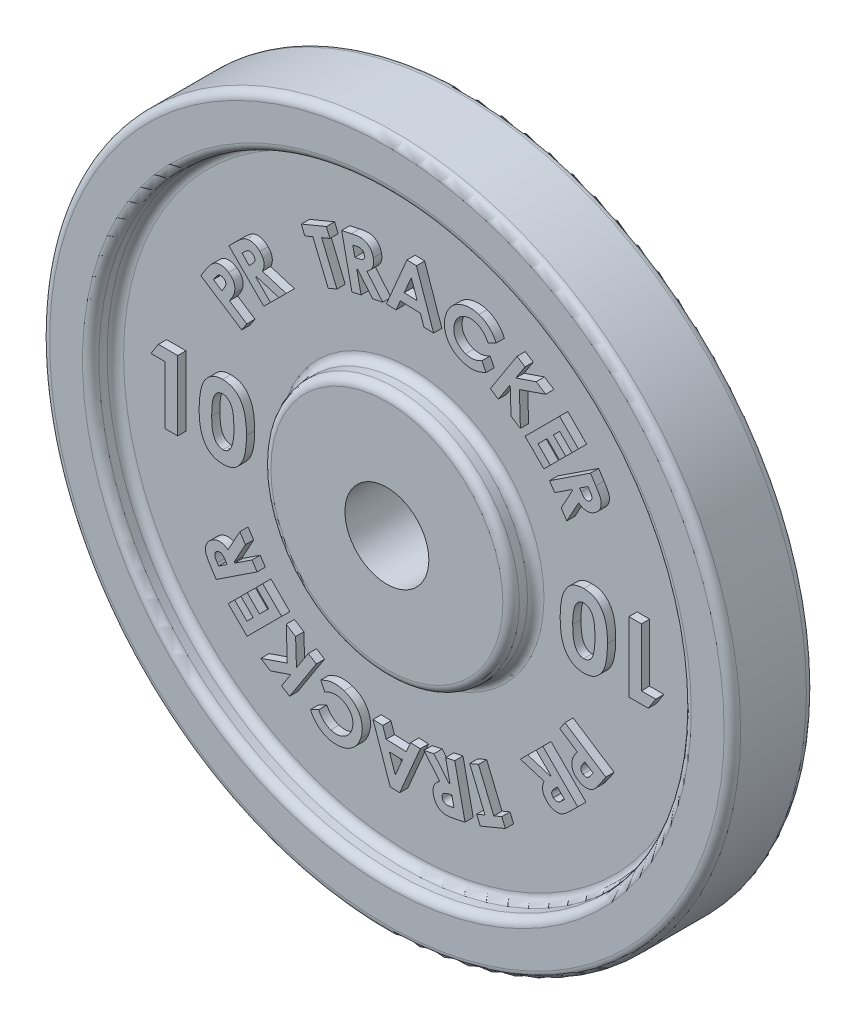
from build123d import *

# Parameters (mm, degrees)
ESBO_O1_R                = 21
ESBO_O1_R_2              = 2.55
RESSALTO_EXTRUS_O1_DEPTH = 5
ESBO_O2_R                = 18
ESBO_O2_R_2              = 7.55
CORTE_EXTRUS_O1_DEPTH    = 1.5
FILETE1_R                = 0.5
RESSALTO_EXTRUS_O2_DEPTH = 0.5
RESSALTO_EXTRUS_O3_DEPTH = 0.5
PADR_OCIRCULAR1_COUNT    = 2
FILETE2_R                = 0.5
FILETE3_R                = 0.5
RESSALTO_EXTRUS_O4_DEPTH = 0.5
RESSALTO_EXTRUS_O5_DEPTH = 0.5
PADR_OCIRCULAR2_COUNT    = 2


with BuildPart() as part:
    # Esbo_o1 → Ressalto-extrus_o1 (new body)
    with BuildSketch(Plane.XY):
        Circle(ESBO_O1_R)
        Circle(ESBO_O1_R_2, mode=Mode.SUBTRACT)
    extrude(amount=RESSALTO_EXTRUS_O1_DEPTH)

    # Esbo_o2 → Corte-extrus_o1 (cut)
    with BuildSketch(Plane.XY.offset(5)):
        Circle(ESBO_O2_R)
        Circle(ESBO_O2_R_2, mode=Mode.SUBTRACT)
    corte_extrus_o1 = extrude(amount=-CORTE_EXTRUS_O1_DEPTH, mode=Mode.SUBTRACT)

    # Filete1
    filete1_edges = [part.edges().sort_by_distance(p)[0] for p in [
        (-7.55, 0, 5),
        (-18, 0, 3.5),
        (-7.55, 0, 3.5),
        (-18, 0, 5),
    ]]
    fillet(filete1_edges, radius=FILETE1_R)

    # Esbo_o3 → Ressalto-extrus_o2 (add)
    # profile 1 of 9: a face of its own
    with BuildSketch(Plane.XY.offset(3.5)):
        with BuildLine():
            Line((11.372106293, 8.482696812), (11.70263514, 7.980893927))
            add(Edge.make_bspline(
                [(11.70263514, 7.980893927), (11.724196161, 7.947521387), (11.76576219, 7.883184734), (11.823642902, 7.789141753), (11.873676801, 7.700688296), (11.916269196, 7.618168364), (11.9531268, 7.542072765), (11.980870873, 7.471076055), (12.003586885, 7.406664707), (12.021625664, 7.328534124), (12.03179376, 7.234371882), (12.026669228, 7.122080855), (12.001764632, 7.010507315), (11.967025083, 6.919591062), (11.931859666, 6.848115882), (11.899674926, 6.79663945), (11.864071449, 6.746943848), (11.824230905, 6.699405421), (11.780243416, 6.653640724), (11.732185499, 6.609991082), (11.680364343, 6.567911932), (11.642951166, 6.542901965), (11.623909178, 6.530172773)],
                knots=[0, 0, 0, 0, 1.424579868, 2.746350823, 3.958867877, 5.067175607, 6.076040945, 6.988342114, 7.799210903, 8.522229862, 9.85875015, 11.181925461, 12.534388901, 13.939130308, 14.6618638, 15.387446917, 16.113030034, 16.852417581, 17.609320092, 18.387197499, 19.179140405, 20, 20, 20, 20], degree=3))
            add(Edge.make_bspline(
                [(11.623909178, 6.530172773), (11.603651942, 6.517253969), (11.563893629, 6.491898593), (11.502471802, 6.459700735), (11.441435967, 6.4320533), (11.380132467, 6.410855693), (11.319315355, 6.393320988), (11.258225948, 6.382908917), (11.197384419, 6.37656645), (11.136436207, 6.37605724), (11.075684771, 6.380787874), (11.01502661, 6.391326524), (10.954290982, 6.40654737), (10.894169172, 6.429160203), (10.833127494, 6.454272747), (10.77304555, 6.486804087), (10.712688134, 6.523926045), (10.673802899, 6.552333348), (10.653957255, 6.566831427)],
                knots=[0, 0, 0, 0, 1.102086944, 2.163035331, 3.179481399, 4.173821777, 5.137300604, 6.080390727, 7.013391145, 7.941897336, 8.873265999, 9.805722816, 10.76445368, 11.741476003, 12.750579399, 13.790977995, 14.872593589, 16, 16, 16, 16], degree=3))
            Line((10.653957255, 6.566831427), (9.936409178, 5.250124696))
            Line((9.936409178, 5.250124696), (9.595663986, 5.766951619))
            Line((9.595663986, 5.766951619), (10.279558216, 7.020557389))
            Line((10.279558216, 7.020557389), (10.250712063, 7.065028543))
            Line((10.250712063, 7.065028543), (9.197827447, 6.370917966))
            Line((9.197827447, 6.370917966), (8.885928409, 6.843874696))
            Line((8.885928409, 6.843874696), (11.372106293, 8.482696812))
        make_face()
        with BuildLine():
            Line((10.712250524, 7.369115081), (10.810207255, 7.220076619))
            add(Edge.make_bspline(
                [(10.810207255, 7.220076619), (10.82222925, 7.201908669), (10.845308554, 7.167030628), (10.881668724, 7.119046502), (10.916195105, 7.076232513), (10.949997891, 7.039374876), (10.982453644, 7.008009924), (11.013544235, 6.981619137), (11.044400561, 6.961738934), (11.083194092, 6.942255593), (11.134321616, 6.929880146), (11.19829258, 6.932687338), (11.264419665, 6.953846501), (11.305669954, 6.978554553), (11.32763514, 6.991711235)],
                knots=[0, 0, 0, 0, 1.203101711, 2.309662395, 3.324143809, 4.240453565, 5.070005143, 5.816667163, 6.488851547, 7.092611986, 8.2090873, 9.349703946, 10.588755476, 12, 12, 12, 12], degree=3))
            add(Edge.make_bspline(
                [(11.32763514, 6.991711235), (11.340342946, 7.000767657), (11.365409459, 7.01863171), (11.397276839, 7.051005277), (11.422317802, 7.087453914), (11.441728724, 7.126408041), (11.454266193, 7.167891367), (11.460187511, 7.210446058), (11.460451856, 7.253814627), (11.452661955, 7.300191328), (11.434169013, 7.353004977), (11.403911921, 7.416123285), (11.360818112, 7.491805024), (11.326138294, 7.545387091), (11.307202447, 7.574643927)],
                knots=[0, 0, 0, 0, 0.842179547, 1.661223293, 2.4389524, 3.223208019, 4.003944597, 4.769372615, 5.537932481, 6.338747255, 7.29721474, 8.551489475, 10.117047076, 12, 12, 12, 12], degree=3))
            Line((11.307202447, 7.574643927), (11.221264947, 7.705052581))
            Line((11.221264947, 7.705052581), (10.712250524, 7.369115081))
        make_face(mode=Mode.SUBTRACT)
    # profile 2 of 9: a face of its own
    with BuildSketch(Plane.XY.offset(3.5)):
        Polygon((9.497131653, 10.539133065), (10.643766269, 9.392498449), (10.252540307, 9.001272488), (9.503141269, 9.750671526), (9.123333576, 9.370863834), (9.872732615, 8.621464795), (9.488718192, 8.237450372), (8.739319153, 8.986849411), (8.187035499, 8.434565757), (8.936434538, 7.685166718), (8.544006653, 7.292738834), (7.397372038, 8.439373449), align=None)
    # profile 3 of 9: a face of its own
    with BuildSketch(Plane.XY.offset(3.5)):
        Polygon((6.914354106, 12.404591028), (7.398128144, 12.092091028), (6.838632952, 11.227307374), (8.080219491, 11.650384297), (8.655940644, 11.277788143), (7.053176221, 10.72550449), (7.11507526, 8.709278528), (6.547767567, 9.075865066), (6.494281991, 10.69425449), (5.771926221, 9.578268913), (5.288152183, 9.890768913), align=None)
    # profile 4 of 9: a face of its own
    with BuildSketch(Plane.XY.offset(3.5)):
        with BuildLine():
            Line((5.643245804, 12.465489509), (5.14564965, 12.22750874))
            add(Edge.make_bspline(
                [(5.14564965, 12.22750874), (5.124240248, 12.270637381), (5.08238287, 12.354957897), (5.00706436, 12.470935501), (4.925885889, 12.576147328), (4.8364413, 12.668755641), (4.740854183, 12.750845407), (4.636864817, 12.819650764), (4.526124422, 12.877448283), (4.447693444, 12.906043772), (4.408269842, 12.920417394)],
                knots=[0, 0, 0, 0, 1.108720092, 2.167651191, 3.18060078, 4.166538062, 5.129360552, 6.078037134, 7.033918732, 8, 8, 8, 8], degree=3))
            add(Edge.make_bspline(
                [(4.408269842, 12.920417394), (4.374572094, 12.930426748), (4.308244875, 12.950128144), (4.20743273, 12.969055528), (4.107941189, 12.976362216), (4.009462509, 12.975892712), (3.912242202, 12.963380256), (3.815944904, 12.941789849), (3.72111022, 12.909667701), (3.628914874, 12.867530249), (3.540271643, 12.818525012), (3.458639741, 12.760702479), (3.383840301, 12.69679356), (3.317503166, 12.624839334), (3.257358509, 12.547286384), (3.205773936, 12.461756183), (3.160882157, 12.369669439), (3.137626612, 12.304480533), (3.125817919, 12.271378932)],
                knots=[0, 0, 0, 0, 1.052060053, 2.070767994, 3.063437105, 4.035120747, 5.014106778, 5.991861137, 6.985689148, 8.005720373, 9.023421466, 10.013478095, 10.995783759, 11.96331235, 12.938580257, 13.929127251, 14.948452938, 16, 16, 16, 16], degree=3))
            add(Edge.make_bspline(
                [(3.125817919, 12.271378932), (3.118498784, 12.247826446), (3.104097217, 12.201483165), (3.088054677, 12.131334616), (3.075938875, 12.062137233), (3.067945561, 11.993527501), (3.06487748, 11.925441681), (3.066897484, 11.858001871), (3.072609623, 11.791291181), (3.083667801, 11.725686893), (3.098584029, 11.661415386), (3.117746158, 11.598917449), (3.141327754, 11.538489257), (3.169232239, 11.47995944), (3.200812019, 11.422929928), (3.237072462, 11.368310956), (3.277089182, 11.31540859), (3.321216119, 11.264964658), (3.368772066, 11.216562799), (3.419521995, 11.171968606), (3.473001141, 11.130439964), (3.529513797, 11.092992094), (3.588517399, 11.057556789), (3.650877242, 11.026911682), (3.715625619, 10.998527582), (3.760506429, 10.983385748), (3.783269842, 10.975705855)],
                knots=[0, 0, 0, 0, 1.08983963, 2.1444336, 3.178001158, 4.193971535, 5.19552419, 6.187598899, 7.174443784, 8.152670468, 9.125633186, 10.089121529, 11.039541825, 11.990127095, 12.953371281, 13.918526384, 14.88546701, 15.883372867, 16.878918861, 17.882661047, 18.867398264, 19.869381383, 20.877721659, 21.907298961, 22.938588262, 24, 24, 24, 24], degree=3))
            add(Edge.make_bspline(
                [(3.783269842, 10.975705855), (3.82212513, 10.96407343), (3.898580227, 10.941184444), (4.015139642, 10.921347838), (4.130158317, 10.915055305), (4.225424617, 10.918680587), (4.301950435, 10.930417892), (4.362185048, 10.942341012), (4.425160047, 10.95866318), (4.490718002, 10.979184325), (4.558828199, 11.004016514), (4.62946354, 11.032959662), (4.703130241, 11.065380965), (4.752502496, 11.089513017), (4.777861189, 11.101907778)],
                knots=[0, 0, 0, 0, 1.412340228, 2.779045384, 4.10748043, 5.421237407, 6.091506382, 6.803337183, 7.560088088, 8.35707087, 9.196132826, 10.085318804, 11.016576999, 12, 12, 12, 12], degree=3))
            Line((4.777861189, 11.101907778), (5.020048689, 10.599503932))
            add(Edge.make_bspline(
                [(5.020048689, 10.599503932), (4.986137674, 10.582965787), (4.91971388, 10.550571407), (4.819970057, 10.508372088), (4.723678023, 10.470788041), (4.630302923, 10.438698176), (4.539814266, 10.412426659), (4.452316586, 10.390824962), (4.367745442, 10.376061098), (4.285510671, 10.365955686), (4.204189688, 10.362076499), (4.122362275, 10.362044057), (4.039098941, 10.366209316), (3.95461992, 10.375168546), (3.868879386, 10.389396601), (3.781937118, 10.407109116), (3.69381468, 10.430250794), (3.635166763, 10.448440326), (3.605385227, 10.457677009)],
                knots=[0, 0, 0, 0, 1.235616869, 2.420286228, 3.546204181, 4.621062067, 5.653067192, 6.631820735, 7.5714333, 8.463446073, 9.343896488, 10.236271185, 11.14293321, 12.073336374, 13.017223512, 13.98880256, 14.978709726, 16, 16, 16, 16], degree=3))
            add(Edge.make_bspline(
                [(3.605385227, 10.457677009), (3.551727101, 10.476565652), (3.446398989, 10.513643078), (3.297649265, 10.584292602), (3.161014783, 10.665870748), (3.035742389, 10.757492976), (2.922155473, 10.860013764), (2.820622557, 10.973645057), (2.731387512, 11.098072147), (2.654896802, 11.231948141), (2.591081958, 11.372150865), (2.543576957, 11.517568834), (2.51058845, 11.665663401), (2.494729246, 11.817233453), (2.49340558, 11.971430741), (2.508187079, 12.128829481), (2.538861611, 12.289174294), (2.570587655, 12.395221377), (2.586755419, 12.449263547)],
                knots=[0, 0, 0, 0, 1.087256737, 2.134228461, 3.142668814, 4.126448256, 5.097398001, 6.063225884, 7.034900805, 8.019872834, 9.007433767, 9.975333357, 10.94012752, 11.903376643, 12.884071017, 13.884292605, 14.921823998, 16, 16, 16, 16], degree=3))
            add(Edge.make_bspline(
                [(2.586755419, 12.449263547), (2.598710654, 12.484095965), (2.622351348, 12.552974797), (2.665512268, 12.65208616), (2.712703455, 12.746597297), (2.765297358, 12.83581344), (2.822358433, 12.920395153), (2.885131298, 12.999649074), (2.952295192, 13.074640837), (3.025439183, 13.143444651), (3.102079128, 13.208027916), (3.183365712, 13.26630797), (3.268736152, 13.318674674), (3.357150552, 13.366279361), (3.450083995, 13.4073008), (3.546606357, 13.442756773), (3.647299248, 13.471979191), (3.750740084, 13.496147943), (3.856160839, 13.5133832), (3.962121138, 13.524247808), (4.067899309, 13.528599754), (4.173333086, 13.525669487), (4.278030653, 13.51504725), (4.38247792, 13.499035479), (4.486764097, 13.475736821), (4.555235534, 13.454541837), (4.589760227, 13.443854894)],
                knots=[0, 0, 0, 0, 1.061962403, 2.099961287, 3.115586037, 4.107642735, 5.085323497, 6.056407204, 7.021973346, 7.986605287, 8.950665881, 9.911273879, 10.868678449, 11.838127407, 12.805645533, 13.796506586, 14.802219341, 15.828295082, 16.859046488, 17.881389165, 18.899230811, 19.910902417, 20.921170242, 21.932973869, 22.95776332, 24, 24, 24, 24], degree=3))
            add(Edge.make_bspline(
                [(4.589760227, 13.443854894), (4.618936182, 13.433780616), (4.676886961, 13.413770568), (4.761345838, 13.377748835), (4.843666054, 13.338236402), (4.923879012, 13.294368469), (5.001343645, 13.245522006), (5.076553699, 13.192561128), (5.149572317, 13.135420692), (5.219496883, 13.073515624), (5.286779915, 13.008408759), (5.349692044, 12.939580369), (5.409691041, 12.868696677), (5.464914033, 12.794246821), (5.515403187, 12.716290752), (5.562227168, 12.635625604), (5.605999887, 12.552367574), (5.630803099, 12.494512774), (5.643245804, 12.465489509)],
                knots=[0, 0, 0, 0, 0.998866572, 1.984000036, 2.970072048, 3.953860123, 4.941572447, 5.932833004, 6.93037271, 7.941144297, 8.954553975, 9.959547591, 10.958329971, 11.959530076, 12.957722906, 13.963113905, 14.978181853, 16, 16, 16, 16], degree=3))
        make_face()
    # profile 5 of 9: a face of its own
    with BuildSketch(Plane.XY.offset(3.5)):
        Polygon((0.221709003, 14.132780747), (0.798031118, 14.112949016), (1.841300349, 11.088910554), (1.251156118, 11.109343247), (1.039617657, 11.732540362), (-0.177329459, 11.775208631), (-0.442353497, 11.168838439), (-1.03309869, 11.189271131), align=None)
        Polygon((0.48613208, 13.331098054), (0.05283881, 12.320881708), (0.84550708, 12.293237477), align=None, mode=Mode.SUBTRACT)
    # profile 6 of 9: a face of its own
    with BuildSketch(Plane.XY.offset(3.5)):
        with BuildLine():
            Line((-3.748977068, 13.699248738), (-3.157630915, 13.825450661))
            add(Edge.make_bspline(
                [(-3.157630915, 13.825450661), (-3.11861599, 13.833511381), (-3.043380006, 13.849055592), (-2.934083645, 13.867484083), (-2.832907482, 13.882026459), (-2.739971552, 13.892808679), (-2.655085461, 13.897468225), (-2.578472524, 13.898277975), (-2.509931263, 13.895221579), (-2.448440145, 13.886614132), (-2.392018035, 13.873700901), (-2.338344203, 13.856855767), (-2.286494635, 13.835739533), (-2.236425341, 13.810444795), (-2.18841238, 13.780791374), (-2.141582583, 13.747562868), (-2.096919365, 13.709826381), (-2.054116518, 13.66827923), (-2.014059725, 13.623221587), (-1.976360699, 13.575329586), (-1.943582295, 13.523161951), (-1.91349983, 13.46837792), (-1.886135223, 13.410817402), (-1.863720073, 13.349652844), (-1.843355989, 13.285833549), (-1.833382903, 13.241604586), (-1.828303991, 13.219080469)],
                knots=[0, 0, 0, 0, 1.704973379, 3.287853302, 4.742851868, 6.079738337, 7.290568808, 8.379457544, 9.358207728, 10.223935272, 11.033000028, 11.832927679, 12.628986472, 13.426521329, 14.230847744, 15.042135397, 15.881916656, 16.730752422, 17.592991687, 18.460754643, 19.335982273, 20.226199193, 21.135209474, 22.060410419, 23.012241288, 24, 24, 24, 24], degree=3))
            add(Edge.make_bspline(
                [(-1.828303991, 13.219080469), (-1.823872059, 13.195484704), (-1.815156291, 13.14908165), (-1.806151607, 13.079895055), (-1.804393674, 13.012561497), (-1.805508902, 12.947236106), (-1.813270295, 12.884248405), (-1.824014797, 12.822858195), (-1.842141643, 12.764069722), (-1.863436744, 12.706792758), (-1.890100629, 12.651605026), (-1.922242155, 12.59876618), (-1.958776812, 12.547363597), (-2.001295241, 12.498744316), (-2.048305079, 12.451798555), (-2.100051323, 12.406492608), (-2.157370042, 12.363888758), (-2.198138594, 12.337636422), (-2.218928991, 12.324248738)],
                knots=[0, 0, 0, 0, 1.09581435, 2.155011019, 3.179669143, 4.167483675, 5.133737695, 6.073368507, 7.007780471, 7.936629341, 8.860786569, 9.800016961, 10.756576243, 11.735379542, 12.74392103, 13.787214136, 14.871564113, 16, 16, 16, 16], degree=3))
            Line((-2.218928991, 12.324248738), (-1.24957803, 11.169801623))
            Line((-1.24957803, 11.169801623), (-1.858352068, 11.040594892))
            Line((-1.858352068, 11.040594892), (-2.78082803, 12.140955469))
            Line((-2.78082803, 12.140955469), (-2.832510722, 12.130138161))
            Line((-2.832510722, 12.130138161), (-2.569289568, 10.889753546))
            Line((-2.569289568, 10.889753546), (-3.126981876, 10.770763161))
            Line((-3.126981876, 10.770763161), (-3.748977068, 13.699248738))
        make_face()
        with BuildLine():
            Line((-2.947895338, 12.673407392), (-2.77301553, 12.710066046))
            add(Edge.make_bspline(
                [(-2.77301553, 12.710066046), (-2.751752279, 12.714951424), (-2.710882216, 12.724341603), (-2.652449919, 12.739833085), (-2.599637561, 12.7564915), (-2.55256387, 12.774327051), (-2.511544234, 12.793726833), (-2.475741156, 12.813396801), (-2.445380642, 12.834177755), (-2.420718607, 12.857047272), (-2.400569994, 12.881222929), (-2.384681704, 12.907606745), (-2.372570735, 12.936138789), (-2.364310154, 12.966885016), (-2.3592735, 12.999749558), (-2.35908776, 13.034847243), (-2.361960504, 13.072080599), (-2.366720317, 13.097320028), (-2.369169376, 13.11030643)],
                knots=[0, 0, 0, 0, 1.598184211, 3.071867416, 4.427024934, 5.653385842, 6.756228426, 7.748257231, 8.643888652, 9.443485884, 10.204445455, 10.941834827, 11.691389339, 12.467479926, 13.268557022, 14.119810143, 15.03258895, 16, 16, 16, 16], degree=3))
            add(Edge.make_bspline(
                [(-2.369169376, 13.11030643), (-2.372857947, 13.125700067), (-2.380042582, 13.155683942), (-2.399338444, 13.197067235), (-2.423545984, 13.234165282), (-2.452965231, 13.266917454), (-2.487429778, 13.29339287), (-2.524430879, 13.316209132), (-2.56574844, 13.330438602), (-2.602384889, 13.339094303), (-2.634940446, 13.342056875), (-2.663868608, 13.342735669), (-2.696718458, 13.340386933), (-2.733862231, 13.337731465), (-2.774906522, 13.332025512), (-2.82036844, 13.324713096), (-2.869883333, 13.315816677), (-2.904241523, 13.308704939), (-2.922053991, 13.305017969)],
                knots=[0, 0, 0, 0, 1.131166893, 2.203297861, 3.249782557, 4.295873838, 5.337726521, 6.353877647, 7.393258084, 8.45137998, 9.042365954, 9.731131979, 10.521344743, 11.399396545, 12.397667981, 13.487316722, 14.697338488, 16, 16, 16, 16], degree=3))
            Line((-2.922053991, 13.305017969), (-3.075299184, 13.272566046))
            Line((-3.075299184, 13.272566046), (-2.947895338, 12.673407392))
        make_face(mode=Mode.SUBTRACT)
    # profile 7 of 9: a face of its own
    with BuildSketch(Plane.XY.offset(3.5)):
        Polygon((-6.202171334, 12.807926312), (-4.675128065, 13.440738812), (-4.459983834, 12.922109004), (-4.963589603, 12.712974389), (-4.033902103, 10.468984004), (-4.566954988, 10.24843112), (-5.496642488, 12.492421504), (-5.987027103, 12.289296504), align=None)
    # profile 8 of 9: a face of its own
    with BuildSketch(Plane.XY.offset(3.5)):
        with BuildLine():
            Line((-10.599505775, 9.467272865), (-10.169818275, 9.895758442))
            add(Edge.make_bspline(
                [(-10.169818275, 9.895758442), (-10.141316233, 9.923753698), (-10.086316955, 9.977775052), (-10.004693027, 10.053245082), (-9.927847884, 10.121209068), (-9.854635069, 10.179596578), (-9.786650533, 10.230950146), (-9.722492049, 10.272906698), (-9.66276536, 10.307043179), (-9.58963716, 10.341521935), (-9.498181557, 10.370464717), (-9.385940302, 10.386720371), (-9.270852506, 10.385232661), (-9.174136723, 10.36969788), (-9.097020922, 10.348445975), (-9.039330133, 10.327835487), (-8.983116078, 10.302648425), (-8.927889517, 10.272904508), (-8.874022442, 10.238562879), (-8.820893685, 10.200242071), (-8.769754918, 10.156522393), (-8.73697313, 10.125088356), (-8.720299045, 10.109099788)],
                knots=[0, 0, 0, 0, 1.421133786, 2.742306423, 3.954344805, 5.069496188, 6.072872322, 6.984049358, 7.794588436, 8.518273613, 9.856972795, 11.189283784, 12.536208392, 13.936227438, 14.660613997, 15.379652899, 16.113338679, 16.849856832, 17.609021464, 18.384434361, 19.178260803, 20, 20, 20, 20], degree=3))
            add(Edge.make_bspline(
                [(-8.720299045, 10.109099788), (-8.703367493, 10.091744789), (-8.670215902, 10.057764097), (-8.626574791, 10.003113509), (-8.587171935, 9.948329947), (-8.552602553, 9.892608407), (-8.524439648, 9.835297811), (-8.501444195, 9.777178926), (-8.483314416, 9.718356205), (-8.470503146, 9.658431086), (-8.463587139, 9.597468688), (-8.460710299, 9.53555021), (-8.464938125, 9.472467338), (-8.473067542, 9.408335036), (-8.487039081, 9.343233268), (-8.506670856, 9.277286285), (-8.530984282, 9.210072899), (-8.551304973, 9.165854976), (-8.561645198, 9.143354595)],
                knots=[0, 0, 0, 0, 1.103197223, 2.160034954, 3.179906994, 4.174678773, 5.141294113, 6.082891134, 7.017573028, 7.940524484, 8.868105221, 9.808155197, 10.758194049, 11.742332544, 12.749361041, 13.785374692, 14.873083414, 16, 16, 16, 16], degree=3))
            Line((-8.561645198, 9.143354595), (-7.116332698, 8.698643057))
            Line((-7.116332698, 8.698643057), (-7.558640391, 8.258138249))
            Line((-7.558640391, 8.258138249), (-8.934842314, 8.681816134))
            Line((-8.934842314, 8.681816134), (-8.972101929, 8.644556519))
            Line((-8.972101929, 8.644556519), (-8.074866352, 7.743715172))
            Line((-8.074866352, 7.743715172), (-8.479914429, 7.339869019))
            Line((-8.479914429, 7.339869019), (-10.599505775, 9.467272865))
        make_face()
        with BuildLine():
            Line((-9.365731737, 9.039388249), (-9.238928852, 9.165590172))
            add(Edge.make_bspline(
                [(-9.238928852, 9.165590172), (-9.223627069, 9.181339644), (-9.1941939, 9.211633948), (-9.153196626, 9.256307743), (-9.118169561, 9.299445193), (-9.087893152, 9.33978526), (-9.063884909, 9.378651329), (-9.04410206, 9.414677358), (-9.030162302, 9.448956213), (-9.018589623, 9.491275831), (-9.016852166, 9.544258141), (-9.031818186, 9.607060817), (-9.066072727, 9.668099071), (-9.098869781, 9.703716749), (-9.116332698, 9.722681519)],
                knots=[0, 0, 0, 0, 1.202674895, 2.313360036, 3.319177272, 4.245179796, 5.073189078, 5.819223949, 6.493567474, 7.094979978, 8.214892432, 9.353828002, 10.591035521, 12, 12, 12, 12], degree=3))
            add(Edge.make_bspline(
                [(-9.116332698, 9.722681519), (-9.127824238, 9.733508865), (-9.150421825, 9.754800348), (-9.189346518, 9.779172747), (-9.230006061, 9.797904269), (-9.272853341, 9.80847089), (-9.316140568, 9.812471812), (-9.359674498, 9.811300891), (-9.402203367, 9.800892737), (-9.43762212, 9.788141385), (-9.46625409, 9.772592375), (-9.490907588, 9.757895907), (-9.517199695, 9.737993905), (-9.546842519, 9.715441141), (-9.578406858, 9.688202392), (-9.612880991, 9.65736726), (-9.649898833, 9.622852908), (-9.674898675, 9.597956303), (-9.687847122, 9.585061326)],
                knots=[0, 0, 0, 0, 1.125004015, 2.212269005, 3.262387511, 4.310165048, 5.344972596, 6.361525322, 7.402641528, 8.457426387, 9.039724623, 9.726656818, 10.504926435, 11.391944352, 12.386519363, 13.4806323, 14.695115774, 16, 16, 16, 16], degree=3))
            Line((-9.687847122, 9.585061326), (-9.799025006, 9.474484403))
            Line((-9.799025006, 9.474484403), (-9.365731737, 9.039388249))
        make_face(mode=Mode.SUBTRACT)
    # profile 9 of 9: a face of its own
    with BuildSketch(Plane.XY.offset(3.5)):
        with BuildLine():
            Line((-12.308870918, 7.044325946), (-11.98134688, 7.546128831))
            add(Edge.make_bspline(
                [(-11.98134688, 7.546128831), (-11.959636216, 7.578665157), (-11.917812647, 7.641343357), (-11.855330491, 7.730623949), (-11.794968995, 7.811310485), (-11.735855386, 7.882605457), (-11.68030535, 7.94608901), (-11.626652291, 8.000619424), (-11.575068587, 8.046433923), (-11.52510025, 8.084536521), (-11.475246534, 8.115763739), (-11.425066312, 8.142230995), (-11.373249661, 8.163866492), (-11.320451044, 8.182383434), (-11.265729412, 8.194956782), (-11.210059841, 8.20521918), (-11.152905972, 8.209628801), (-11.074873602, 8.210581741), (-10.975389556, 8.200198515), (-10.856174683, 8.170027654), (-10.737536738, 8.119701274), (-10.662507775, 8.074349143), (-10.623774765, 8.050936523)],
                knots=[0, 0, 0, 0, 1.407136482, 2.710717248, 3.919990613, 5.030955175, 6.041784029, 6.953954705, 7.781053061, 8.521898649, 9.211703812, 9.895079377, 10.560316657, 11.230338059, 11.905032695, 12.577993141, 13.26504473, 13.964123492, 15.383954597, 16.848671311, 18.373155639, 20, 20, 20, 20], degree=3))
            add(Edge.make_bspline(
                [(-10.623774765, 8.050936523), (-10.602739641, 8.036594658), (-10.561692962, 8.0086088), (-10.504605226, 7.962631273), (-10.45359978, 7.913595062), (-10.406916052, 7.863064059), (-10.367281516, 7.808759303), (-10.331957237, 7.752813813), (-10.302615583, 7.694018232), (-10.279094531, 7.632979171), (-10.261259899, 7.570345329), (-10.247856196, 7.50671609), (-10.240040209, 7.441975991), (-10.237618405, 7.376441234), (-10.240851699, 7.310158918), (-10.248630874, 7.243056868), (-10.261786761, 7.174910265), (-10.274673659, 7.129776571), (-10.281226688, 7.106825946)],
                knots=[0, 0, 0, 0, 1.124608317, 2.194493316, 3.233698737, 4.248804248, 5.229486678, 6.199567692, 7.169325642, 8.127585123, 9.085599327, 10.043777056, 10.997776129, 11.963162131, 12.9377548, 13.92690783, 14.945826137, 16, 16, 16, 16], degree=3))
            add(Edge.make_bspline(
                [(-10.281226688, 7.106825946), (-10.286271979, 7.092141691), (-10.297181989, 7.060388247), (-10.318515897, 7.010437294), (-10.346025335, 6.954630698), (-10.378136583, 6.891893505), (-10.417824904, 6.823723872), (-10.461958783, 6.748474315), (-10.512639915, 6.667567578), (-10.548589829, 6.611791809), (-10.56728438, 6.582787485)],
                knots=[0, 0, 0, 0, 0.622537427, 1.346183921, 2.176173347, 3.117576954, 4.171813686, 5.338785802, 6.616124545, 8, 8, 8, 8], degree=3))
            Line((-10.56728438, 6.582787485), (-9.514399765, 5.896489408))
            Line((-9.514399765, 5.896489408), (-9.822693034, 5.423532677))
            Line((-9.822693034, 5.423532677), (-12.308870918, 7.044325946))
        make_face()
        with BuildLine():
            Line((-11.028822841, 6.883869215), (-10.930265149, 7.034710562))
            add(Edge.make_bspline(
                [(-10.930265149, 7.034710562), (-10.912702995, 7.062157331), (-10.880443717, 7.112573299), (-10.840977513, 7.184219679), (-10.811208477, 7.243531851), (-10.794506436, 7.294263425), (-10.787318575, 7.338945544), (-10.787502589, 7.380666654), (-10.793223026, 7.421802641), (-10.806926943, 7.461344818), (-10.825809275, 7.499358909), (-10.8519373, 7.534169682), (-10.883729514, 7.566495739), (-10.90929918, 7.583999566), (-10.922452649, 7.593003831)],
                knots=[0, 0, 0, 0, 1.82986352, 3.361209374, 4.594483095, 5.551825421, 6.349238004, 7.125730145, 7.888067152, 8.670975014, 9.466161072, 10.26293814, 11.106426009, 12, 12, 12, 12], degree=3))
            add(Edge.make_bspline(
                [(-10.922452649, 7.593003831), (-10.934309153, 7.600318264), (-10.957170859, 7.614421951), (-10.993212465, 7.630081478), (-11.028808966, 7.641335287), (-11.064689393, 7.646638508), (-11.100257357, 7.647302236), (-11.135694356, 7.643086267), (-11.17099314, 7.633435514), (-11.193419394, 7.622991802), (-11.204904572, 7.617643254)],
                knots=[0, 0, 0, 0, 1.120226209, 2.160019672, 3.154816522, 4.117323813, 5.068961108, 6.011122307, 6.981434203, 8, 8, 8, 8], degree=3))
            add(Edge.make_bspline(
                [(-11.204904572, 7.617643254), (-11.213847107, 7.612843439), (-11.232650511, 7.602750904), (-11.260106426, 7.582112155), (-11.288481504, 7.556232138), (-11.318961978, 7.525451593), (-11.349627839, 7.488436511), (-11.383023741, 7.447308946), (-11.416466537, 7.399919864), (-11.438948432, 7.366486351), (-11.450697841, 7.349013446)],
                knots=[0, 0, 0, 0, 0.661727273, 1.391409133, 2.234074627, 3.167977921, 4.216097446, 5.369899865, 6.625466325, 8, 8, 8, 8], degree=3))
            Line((-11.450697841, 7.349013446), (-11.537837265, 7.215599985))
            Line((-11.537837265, 7.215599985), (-11.028822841, 6.883869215))
        make_face(mode=Mode.SUBTRACT)
    ressalto_extrus_o2 = extrude(amount=RESSALTO_EXTRUS_O2_DEPTH)

    # Esbo_o5 → Ressalto-extrus_o3 (add)
    # profile 1 of 2: a face of its own
    with BuildSketch(Plane.XY.offset(3.5)):
        Polygon((-14.886658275, 2.133333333), (-13.712145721, 2.133333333), (-13.712145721, -2.1), (-14.471974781, -2.1), (-14.471974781, 1.427777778), (-15.34035085, 1.427777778), align=None)
    # profile 2 of 2: a face of its own
    with BuildSketch(Plane.XY.offset(3.5)):
        with BuildLine():
            add(Edge.make_bspline(
                [(-10.984054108, 2.241880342), (-10.947275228, 2.241334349), (-10.874958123, 2.240260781), (-10.76844864, 2.228633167), (-10.66585056, 2.211067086), (-10.566762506, 2.186568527), (-10.471897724, 2.154145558), (-10.38056577, 2.115335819), (-10.293853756, 2.068103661), (-10.210655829, 2.014752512), (-10.131004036, 1.954351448), (-10.056812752, 1.885491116), (-9.986727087, 1.809755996), (-9.922264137, 1.726001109), (-9.86199635, 1.634988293), (-9.806121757, 1.536703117), (-9.755068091, 1.430664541), (-9.708263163, 1.31668121), (-9.666410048, 1.193044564), (-9.631157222, 1.058336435), (-9.600922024, 0.912526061), (-9.575401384, 0.755250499), (-9.556111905, 0.58630069), (-9.543110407, 0.405788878), (-9.534188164, 0.214063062), (-9.533459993, 0.082540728), (-9.533085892, 0.01497062)],
                knots=[0, 0, 0, 0, 0.879237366, 1.728815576, 2.559023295, 3.367336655, 4.166867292, 4.954216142, 5.737608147, 6.525189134, 7.316157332, 8.124696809, 8.942788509, 9.781158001, 10.649253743, 11.551476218, 12.482711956, 13.461909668, 14.496590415, 15.601789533, 16.789733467, 18.056700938, 19.410929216, 20.8549011, 22.384193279, 24, 24, 24, 24], degree=3))
            add(Edge.make_bspline(
                [(-9.533085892, 0.01497062), (-9.533490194, -0.053444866), (-9.534275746, -0.186374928), (-9.542739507, -0.379854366), (-9.557314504, -0.561676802), (-9.576099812, -0.731823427), (-9.601830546, -0.890204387), (-9.631964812, -1.037229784), (-9.667774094, -1.172846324), (-9.711005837, -1.296748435), (-9.757527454, -1.410931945), (-9.808720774, -1.516763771), (-9.863693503, -1.614530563), (-9.921184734, -1.705707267), (-9.984346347, -1.787606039), (-10.050104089, -1.863011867), (-10.121321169, -1.929052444), (-10.194999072, -1.989131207), (-10.273836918, -2.041051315), (-10.357021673, -2.086459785), (-10.446036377, -2.123291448), (-10.539258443, -2.155325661), (-10.638276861, -2.178322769), (-10.741518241, -2.196570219), (-10.850148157, -2.206654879), (-10.924107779, -2.207905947), (-10.962005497, -2.208547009)],
                knots=[0, 0, 0, 0, 1.643780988, 3.193836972, 4.651895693, 6.025988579, 7.305620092, 8.505800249, 9.631074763, 10.672816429, 11.65661981, 12.592235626, 13.49536222, 14.350718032, 15.179365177, 15.97804903, 16.751647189, 17.51006938, 18.259804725, 19.016521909, 19.783502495, 20.571750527, 21.382245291, 22.22305063, 23.089471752, 24, 24, 24, 24], degree=3))
            add(Edge.make_bspline(
                [(-10.962005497, -2.208547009), (-10.999902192, -2.207893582), (-11.074141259, -2.206613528), (-11.183064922, -2.196645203), (-11.286853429, -2.178248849), (-11.386655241, -2.155149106), (-11.481775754, -2.123362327), (-11.572671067, -2.085428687), (-11.658642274, -2.040303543), (-11.739927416, -1.988262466), (-11.816248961, -1.928585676), (-11.888792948, -1.861911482), (-11.957398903, -1.788408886), (-12.02102316, -1.707254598), (-12.080707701, -1.61953186), (-12.135830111, -1.524238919), (-12.186357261, -1.421514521), (-12.23386965, -1.311215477), (-12.275151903, -1.190967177), (-12.311891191, -1.059695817), (-12.341987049, -0.916307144), (-12.366192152, -0.760847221), (-12.385517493, -0.593645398), (-12.399893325, -0.414620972), (-12.408404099, -0.223690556), (-12.409181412, -0.09245457), (-12.409581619, -0.024886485)],
                knots=[0, 0, 0, 0, 0.917216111, 1.796812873, 2.643793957, 3.46689424, 4.273913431, 5.068098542, 5.848489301, 6.620921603, 7.401012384, 8.190319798, 9.003608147, 9.831726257, 10.68377682, 11.569763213, 12.493818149, 13.453288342, 14.474581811, 15.568529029, 16.750744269, 18.018426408, 19.375425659, 20.823733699, 22.36466933, 24, 24, 24, 24], degree=3))
            add(Edge.make_bspline(
                [(-12.409581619, -0.024886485), (-12.408856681, 0.06899405), (-12.407457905, 0.250137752), (-12.389731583, 0.511837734), (-12.363713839, 0.753734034), (-12.325499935, 0.97542202), (-12.278248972, 1.177722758), (-12.217741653, 1.359303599), (-12.148858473, 1.522677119), (-12.090161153, 1.619460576), (-12.061891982, 1.666072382)],
                knots=[0, 0, 0, 0, 1.288568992, 2.486310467, 3.599230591, 4.627010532, 5.572937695, 6.447898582, 7.252493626, 8, 8, 8, 8], degree=3))
            add(Edge.make_bspline(
                [(-12.061891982, 1.666072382), (-12.029021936, 1.711863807), (-11.96475452, 1.801395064), (-11.852381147, 1.918932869), (-11.731650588, 2.019456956), (-11.600083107, 2.100692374), (-11.459759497, 2.164754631), (-11.309475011, 2.210001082), (-11.149784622, 2.236363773), (-11.040122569, 2.240014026), (-10.984054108, 2.241880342)],
                knots=[0, 0, 0, 0, 1.058512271, 2.069600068, 3.047294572, 4.004278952, 4.967380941, 5.939006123, 6.946246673, 8, 8, 8, 8], degree=3))
        make_face()
        with BuildLine():
            add(Edge.make_bspline(
                [(-10.965397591, 1.482051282), (-10.998646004, 1.480475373), (-11.063830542, 1.477385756), (-11.158416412, 1.451159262), (-11.247604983, 1.410651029), (-11.315448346, 1.361905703), (-11.366228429, 1.315177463), (-11.401708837, 1.272889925), (-11.435924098, 1.225700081), (-11.46614474, 1.171478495), (-11.494680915, 1.112173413), (-11.522569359, 1.047515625), (-11.54543056, 0.975916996), (-11.567891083, 0.898596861), (-11.587568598, 0.813417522), (-11.604054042, 0.719682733), (-11.618782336, 0.616782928), (-11.629055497, 0.504650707), (-11.638633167, 0.383403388), (-11.645498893, 0.25277088), (-11.648369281, 0.112788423), (-11.64928169, 0.016384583), (-11.649752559, -0.03336672)],
                knots=[0, 0, 0, 0, 1.076674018, 2.110852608, 3.161083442, 4.239746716, 4.804137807, 5.395870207, 6.026861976, 6.692161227, 7.405688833, 8.16177676, 8.973626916, 9.841385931, 10.773283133, 11.807421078, 12.927755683, 14.143907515, 15.458935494, 16.872852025, 18.386167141, 20, 20, 20, 20], degree=3))
            add(Edge.make_bspline(
                [(-11.649752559, -0.03336672), (-11.648977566, -0.097821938), (-11.647491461, -0.221419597), (-11.639707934, -0.399157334), (-11.624106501, -0.560912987), (-11.604701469, -0.707782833), (-11.577446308, -0.838814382), (-11.546087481, -0.955247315), (-11.507362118, -1.055597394), (-11.462607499, -1.141315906), (-11.413039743, -1.214236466), (-11.359231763, -1.276219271), (-11.303015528, -1.329893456), (-11.242636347, -1.373492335), (-11.178238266, -1.406904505), (-11.110358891, -1.430937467), (-11.038955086, -1.445649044), (-10.990058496, -1.447689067), (-10.965397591, -1.448717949)],
                knots=[0, 0, 0, 0, 1.771748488, 3.397459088, 4.888034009, 6.237357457, 7.467047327, 8.564189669, 9.548206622, 10.417051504, 11.216568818, 11.965764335, 12.669334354, 13.348544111, 14.005342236, 14.656555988, 15.322436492, 16, 16, 16, 16], degree=3))
            add(Edge.make_bspline(
                [(-10.965397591, -1.448717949), (-10.94158297, -1.448013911), (-10.894956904, -1.446635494), (-10.826965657, -1.432486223), (-10.762668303, -1.409482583), (-10.702258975, -1.376942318), (-10.645521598, -1.335562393), (-10.592733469, -1.285160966), (-10.544292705, -1.225235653), (-10.516070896, -1.180762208), (-10.501528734, -1.157845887)],
                knots=[0, 0, 0, 0, 0.992283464, 1.942767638, 2.88273346, 3.832339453, 4.79467288, 5.803907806, 6.868395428, 8, 8, 8, 8], degree=3))
            add(Edge.make_bspline(
                [(-10.501528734, -1.157845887), (-10.484407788, -1.126531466), (-10.448506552, -1.060867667), (-10.40696158, -0.950062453), (-10.371991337, -0.825092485), (-10.341892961, -0.685568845), (-10.321307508, -0.530941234), (-10.303579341, -0.36219016), (-10.295028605, -0.17846586), (-10.293637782, -0.051181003), (-10.292914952, 0.01497062)],
                knots=[0, 0, 0, 0, 0.710965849, 1.490837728, 2.352621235, 3.297892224, 4.334225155, 5.461620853, 6.680770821, 8, 8, 8, 8], degree=3))
            add(Edge.make_bspline(
                [(-10.292914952, 0.01497062), (-10.293194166, 0.08169647), (-10.293731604, 0.210132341), (-10.303592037, 0.394517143), (-10.317323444, 0.562922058), (-10.337408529, 0.714971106), (-10.363251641, 0.851033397), (-10.395103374, 0.971100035), (-10.432654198, 1.075407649), (-10.477185, 1.16385223), (-10.52650563, 1.239017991), (-10.578860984, 1.303504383), (-10.634472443, 1.358561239), (-10.693247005, 1.404395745), (-10.756545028, 1.439416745), (-10.823157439, 1.464144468), (-10.893220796, 1.479103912), (-10.941013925, 1.481055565), (-10.965397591, 1.482051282)],
                knots=[0, 0, 0, 0, 1.793836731, 3.452829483, 4.963243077, 6.335886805, 7.574563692, 8.684454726, 9.672768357, 10.54971625, 11.340229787, 12.085688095, 12.778991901, 13.440269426, 14.083255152, 14.715733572, 15.344777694, 16, 16, 16, 16], degree=3))
        make_face(mode=Mode.SUBTRACT)
    ressalto_extrus_o3 = extrude(amount=RESSALTO_EXTRUS_O3_DEPTH)

    # Padr_oCircular1: Ressalto-extrus_o2, Ressalto-extrus_o3 ×2 about axis
    padr_ocircular1_axis = Axis((0, 0, 5), (0, 0, 1))
    add([ressalto_extrus_o2.rotate(padr_ocircular1_axis, i * 360 / PADR_OCIRCULAR1_COUNT) for i in range(1, PADR_OCIRCULAR1_COUNT)])
    add([ressalto_extrus_o3.rotate(padr_ocircular1_axis, i * 360 / PADR_OCIRCULAR1_COUNT) for i in range(1, PADR_OCIRCULAR1_COUNT)])

    # Filete2
    filete2_edges = [part.edges().sort_by_distance(p)[0] for p in [
        (-21, 0, 0),
        (-21, 0, 5),
    ]]
    fillet(filete2_edges, radius=FILETE2_R)

    # Espelhar6: Corte-extrus_o1 across plane
    add(corte_extrus_o1.mirror(Plane.XY.offset(2.5)), mode=Mode.SUBTRACT)

    # Filete3
    filete3_edges = [part.edges().sort_by_distance(p)[0] for p in [
        (-7.55, 0, 1.5),
        (-18, 0, 0),
        (-18, 0, 1.5),
        (-7.55, 0, 0),
    ]]
    fillet(filete3_edges, radius=FILETE3_R)

    # Esbo_o10 → Ressalto-extrus_o4 (add)
    # profile 1 of 9: a face of its own
    with BuildSketch(Plane(origin=(0, 0, 1.5), x_dir=(-1, 0, 0), z_dir=(0, 0, -1))):
        with BuildLine():
            Line((11.372106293, 8.482696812), (11.70263514, 7.980893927))
            add(Edge.make_bspline(
                [(11.70263514, 7.980893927), (11.724196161, 7.947521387), (11.76576219, 7.883184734), (11.823642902, 7.789141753), (11.873676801, 7.700688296), (11.916269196, 7.618168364), (11.9531268, 7.542072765), (11.980870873, 7.471076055), (12.003586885, 7.406664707), (12.021625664, 7.328534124), (12.03179376, 7.234371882), (12.026669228, 7.122080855), (12.001764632, 7.010507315), (11.967025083, 6.919591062), (11.931859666, 6.848115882), (11.899674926, 6.79663945), (11.864071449, 6.746943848), (11.824230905, 6.699405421), (11.780243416, 6.653640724), (11.732185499, 6.609991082), (11.680364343, 6.567911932), (11.642951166, 6.542901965), (11.623909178, 6.530172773)],
                knots=[0, 0, 0, 0, 1.424579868, 2.746350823, 3.958867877, 5.067175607, 6.076040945, 6.988342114, 7.799210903, 8.522229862, 9.85875015, 11.181925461, 12.534388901, 13.939130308, 14.6618638, 15.387446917, 16.113030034, 16.852417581, 17.609320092, 18.387197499, 19.179140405, 20, 20, 20, 20], degree=3))
            add(Edge.make_bspline(
                [(11.623909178, 6.530172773), (11.603651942, 6.517253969), (11.563893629, 6.491898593), (11.502471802, 6.459700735), (11.441435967, 6.4320533), (11.380132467, 6.410855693), (11.319315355, 6.393320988), (11.258225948, 6.382908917), (11.197384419, 6.37656645), (11.136436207, 6.37605724), (11.075684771, 6.380787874), (11.01502661, 6.391326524), (10.954290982, 6.40654737), (10.894169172, 6.429160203), (10.833127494, 6.454272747), (10.77304555, 6.486804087), (10.712688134, 6.523926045), (10.673802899, 6.552333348), (10.653957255, 6.566831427)],
                knots=[0, 0, 0, 0, 1.102086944, 2.163035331, 3.179481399, 4.173821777, 5.137300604, 6.080390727, 7.013391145, 7.941897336, 8.873265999, 9.805722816, 10.76445368, 11.741476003, 12.750579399, 13.790977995, 14.872593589, 16, 16, 16, 16], degree=3))
            Line((10.653957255, 6.566831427), (9.936409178, 5.250124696))
            Line((9.936409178, 5.250124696), (9.595663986, 5.766951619))
            Line((9.595663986, 5.766951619), (10.279558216, 7.020557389))
            Line((10.279558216, 7.020557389), (10.250712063, 7.065028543))
            Line((10.250712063, 7.065028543), (9.197827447, 6.370917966))
            Line((9.197827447, 6.370917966), (8.885928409, 6.843874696))
            Line((8.885928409, 6.843874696), (11.372106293, 8.482696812))
        make_face()
        with BuildLine():
            Line((10.712250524, 7.369115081), (10.810207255, 7.220076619))
            add(Edge.make_bspline(
                [(10.810207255, 7.220076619), (10.82222925, 7.201908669), (10.845308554, 7.167030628), (10.881668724, 7.119046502), (10.916195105, 7.076232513), (10.949997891, 7.039374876), (10.982453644, 7.008009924), (11.013544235, 6.981619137), (11.044400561, 6.961738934), (11.083194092, 6.942255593), (11.134321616, 6.929880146), (11.19829258, 6.932687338), (11.264419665, 6.953846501), (11.305669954, 6.978554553), (11.32763514, 6.991711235)],
                knots=[0, 0, 0, 0, 1.203101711, 2.309662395, 3.324143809, 4.240453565, 5.070005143, 5.816667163, 6.488851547, 7.092611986, 8.2090873, 9.349703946, 10.588755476, 12, 12, 12, 12], degree=3))
            add(Edge.make_bspline(
                [(11.32763514, 6.991711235), (11.340342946, 7.000767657), (11.365409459, 7.01863171), (11.397276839, 7.051005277), (11.422317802, 7.087453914), (11.441728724, 7.126408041), (11.454266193, 7.167891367), (11.460187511, 7.210446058), (11.460451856, 7.253814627), (11.452661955, 7.300191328), (11.434169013, 7.353004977), (11.403911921, 7.416123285), (11.360818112, 7.491805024), (11.326138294, 7.545387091), (11.307202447, 7.574643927)],
                knots=[0, 0, 0, 0, 0.842179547, 1.661223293, 2.4389524, 3.223208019, 4.003944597, 4.769372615, 5.537932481, 6.338747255, 7.29721474, 8.551489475, 10.117047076, 12, 12, 12, 12], degree=3))
            Line((11.307202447, 7.574643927), (11.221264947, 7.705052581))
            Line((11.221264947, 7.705052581), (10.712250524, 7.369115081))
        make_face(mode=Mode.SUBTRACT)
    # profile 2 of 9: a face of its own
    with BuildSketch(Plane(origin=(0, 0, 1.5), x_dir=(-1, 0, 0), z_dir=(0, 0, -1))):
        Polygon((9.497131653, 10.539133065), (10.643766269, 9.392498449), (10.252540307, 9.001272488), (9.503141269, 9.750671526), (9.123333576, 9.370863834), (9.872732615, 8.621464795), (9.488718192, 8.237450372), (8.739319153, 8.986849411), (8.187035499, 8.434565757), (8.936434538, 7.685166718), (8.544006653, 7.292738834), (7.397372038, 8.439373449), align=None)
    # profile 3 of 9: a face of its own
    with BuildSketch(Plane(origin=(0, 0, 1.5), x_dir=(-1, 0, 0), z_dir=(0, 0, -1))):
        Polygon((6.914354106, 12.404591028), (7.398128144, 12.092091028), (6.838632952, 11.227307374), (8.080219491, 11.650384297), (8.655940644, 11.277788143), (7.053176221, 10.72550449), (7.11507526, 8.709278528), (6.547767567, 9.075865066), (6.494281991, 10.69425449), (5.771926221, 9.578268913), (5.288152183, 9.890768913), align=None)
    # profile 4 of 9: a face of its own
    with BuildSketch(Plane(origin=(0, 0, 1.5), x_dir=(-1, 0, 0), z_dir=(0, 0, -1))):
        with BuildLine():
            Line((5.643245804, 12.465489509), (5.14564965, 12.22750874))
            add(Edge.make_bspline(
                [(5.14564965, 12.22750874), (5.124240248, 12.270637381), (5.08238287, 12.354957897), (5.00706436, 12.470935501), (4.925885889, 12.576147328), (4.8364413, 12.668755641), (4.740854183, 12.750845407), (4.636864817, 12.819650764), (4.526124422, 12.877448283), (4.447693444, 12.906043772), (4.408269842, 12.920417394)],
                knots=[0, 0, 0, 0, 1.108720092, 2.167651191, 3.18060078, 4.166538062, 5.129360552, 6.078037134, 7.033918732, 8, 8, 8, 8], degree=3))
            add(Edge.make_bspline(
                [(4.408269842, 12.920417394), (4.374572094, 12.930426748), (4.308244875, 12.950128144), (4.20743273, 12.969055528), (4.107941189, 12.976362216), (4.009462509, 12.975892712), (3.912242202, 12.963380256), (3.815944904, 12.941789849), (3.72111022, 12.909667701), (3.628914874, 12.867530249), (3.540271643, 12.818525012), (3.458639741, 12.760702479), (3.383840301, 12.69679356), (3.317503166, 12.624839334), (3.257358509, 12.547286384), (3.205773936, 12.461756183), (3.160882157, 12.369669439), (3.137626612, 12.304480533), (3.125817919, 12.271378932)],
                knots=[0, 0, 0, 0, 1.052060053, 2.070767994, 3.063437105, 4.035120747, 5.014106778, 5.991861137, 6.985689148, 8.005720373, 9.023421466, 10.013478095, 10.995783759, 11.96331235, 12.938580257, 13.929127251, 14.948452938, 16, 16, 16, 16], degree=3))
            add(Edge.make_bspline(
                [(3.125817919, 12.271378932), (3.118498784, 12.247826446), (3.104097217, 12.201483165), (3.088054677, 12.131334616), (3.075938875, 12.062137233), (3.067945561, 11.993527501), (3.06487748, 11.925441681), (3.066897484, 11.858001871), (3.072609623, 11.791291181), (3.083667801, 11.725686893), (3.098584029, 11.661415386), (3.117746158, 11.598917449), (3.141327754, 11.538489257), (3.169232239, 11.47995944), (3.200812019, 11.422929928), (3.237072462, 11.368310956), (3.277089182, 11.31540859), (3.321216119, 11.264964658), (3.368772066, 11.216562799), (3.419521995, 11.171968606), (3.473001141, 11.130439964), (3.529513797, 11.092992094), (3.588517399, 11.057556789), (3.650877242, 11.026911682), (3.715625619, 10.998527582), (3.760506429, 10.983385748), (3.783269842, 10.975705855)],
                knots=[0, 0, 0, 0, 1.08983963, 2.1444336, 3.178001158, 4.193971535, 5.19552419, 6.187598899, 7.174443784, 8.152670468, 9.125633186, 10.089121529, 11.039541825, 11.990127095, 12.953371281, 13.918526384, 14.88546701, 15.883372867, 16.878918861, 17.882661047, 18.867398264, 19.869381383, 20.877721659, 21.907298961, 22.938588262, 24, 24, 24, 24], degree=3))
            add(Edge.make_bspline(
                [(3.783269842, 10.975705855), (3.82212513, 10.96407343), (3.898580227, 10.941184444), (4.015139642, 10.921347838), (4.130158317, 10.915055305), (4.225424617, 10.918680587), (4.301950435, 10.930417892), (4.362185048, 10.942341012), (4.425160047, 10.95866318), (4.490718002, 10.979184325), (4.558828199, 11.004016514), (4.62946354, 11.032959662), (4.703130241, 11.065380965), (4.752502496, 11.089513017), (4.777861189, 11.101907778)],
                knots=[0, 0, 0, 0, 1.412340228, 2.779045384, 4.10748043, 5.421237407, 6.091506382, 6.803337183, 7.560088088, 8.35707087, 9.196132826, 10.085318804, 11.016576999, 12, 12, 12, 12], degree=3))
            Line((4.777861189, 11.101907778), (5.020048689, 10.599503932))
            add(Edge.make_bspline(
                [(5.020048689, 10.599503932), (4.986137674, 10.582965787), (4.91971388, 10.550571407), (4.819970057, 10.508372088), (4.723678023, 10.470788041), (4.630302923, 10.438698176), (4.539814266, 10.412426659), (4.452316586, 10.390824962), (4.367745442, 10.376061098), (4.285510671, 10.365955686), (4.204189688, 10.362076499), (4.122362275, 10.362044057), (4.039098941, 10.366209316), (3.95461992, 10.375168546), (3.868879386, 10.389396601), (3.781937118, 10.407109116), (3.69381468, 10.430250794), (3.635166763, 10.448440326), (3.605385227, 10.457677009)],
                knots=[0, 0, 0, 0, 1.235616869, 2.420286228, 3.546204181, 4.621062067, 5.653067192, 6.631820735, 7.5714333, 8.463446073, 9.343896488, 10.236271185, 11.14293321, 12.073336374, 13.017223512, 13.98880256, 14.978709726, 16, 16, 16, 16], degree=3))
            add(Edge.make_bspline(
                [(3.605385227, 10.457677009), (3.551727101, 10.476565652), (3.446398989, 10.513643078), (3.297649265, 10.584292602), (3.161014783, 10.665870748), (3.035742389, 10.757492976), (2.922155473, 10.860013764), (2.820622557, 10.973645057), (2.731387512, 11.098072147), (2.654896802, 11.231948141), (2.591081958, 11.372150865), (2.543576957, 11.517568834), (2.51058845, 11.665663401), (2.494729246, 11.817233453), (2.49340558, 11.971430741), (2.508187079, 12.128829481), (2.538861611, 12.289174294), (2.570587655, 12.395221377), (2.586755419, 12.449263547)],
                knots=[0, 0, 0, 0, 1.087256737, 2.134228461, 3.142668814, 4.126448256, 5.097398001, 6.063225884, 7.034900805, 8.019872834, 9.007433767, 9.975333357, 10.94012752, 11.903376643, 12.884071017, 13.884292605, 14.921823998, 16, 16, 16, 16], degree=3))
            add(Edge.make_bspline(
                [(2.586755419, 12.449263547), (2.598710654, 12.484095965), (2.622351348, 12.552974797), (2.665512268, 12.65208616), (2.712703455, 12.746597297), (2.765297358, 12.83581344), (2.822358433, 12.920395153), (2.885131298, 12.999649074), (2.952295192, 13.074640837), (3.025439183, 13.143444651), (3.102079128, 13.208027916), (3.183365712, 13.26630797), (3.268736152, 13.318674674), (3.357150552, 13.366279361), (3.450083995, 13.4073008), (3.546606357, 13.442756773), (3.647299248, 13.471979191), (3.750740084, 13.496147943), (3.856160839, 13.5133832), (3.962121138, 13.524247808), (4.067899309, 13.528599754), (4.173333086, 13.525669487), (4.278030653, 13.51504725), (4.38247792, 13.499035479), (4.486764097, 13.475736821), (4.555235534, 13.454541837), (4.589760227, 13.443854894)],
                knots=[0, 0, 0, 0, 1.061962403, 2.099961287, 3.115586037, 4.107642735, 5.085323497, 6.056407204, 7.021973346, 7.986605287, 8.950665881, 9.911273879, 10.868678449, 11.838127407, 12.805645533, 13.796506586, 14.802219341, 15.828295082, 16.859046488, 17.881389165, 18.899230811, 19.910902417, 20.921170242, 21.932973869, 22.95776332, 24, 24, 24, 24], degree=3))
            add(Edge.make_bspline(
                [(4.589760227, 13.443854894), (4.618936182, 13.433780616), (4.676886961, 13.413770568), (4.761345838, 13.377748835), (4.843666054, 13.338236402), (4.923879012, 13.294368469), (5.001343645, 13.245522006), (5.076553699, 13.192561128), (5.149572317, 13.135420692), (5.219496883, 13.073515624), (5.286779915, 13.008408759), (5.349692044, 12.939580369), (5.409691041, 12.868696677), (5.464914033, 12.794246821), (5.515403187, 12.716290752), (5.562227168, 12.635625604), (5.605999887, 12.552367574), (5.630803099, 12.494512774), (5.643245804, 12.465489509)],
                knots=[0, 0, 0, 0, 0.998866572, 1.984000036, 2.970072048, 3.953860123, 4.941572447, 5.932833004, 6.93037271, 7.941144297, 8.954553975, 9.959547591, 10.958329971, 11.959530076, 12.957722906, 13.963113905, 14.978181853, 16, 16, 16, 16], degree=3))
        make_face()
    # profile 5 of 9: a face of its own
    with BuildSketch(Plane(origin=(0, 0, 1.5), x_dir=(-1, 0, 0), z_dir=(0, 0, -1))):
        Polygon((0.221709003, 14.132780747), (0.798031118, 14.112949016), (1.841300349, 11.088910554), (1.251156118, 11.109343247), (1.039617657, 11.732540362), (-0.177329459, 11.775208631), (-0.442353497, 11.168838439), (-1.03309869, 11.189271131), align=None)
        Polygon((0.48613208, 13.331098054), (0.05283881, 12.320881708), (0.84550708, 12.293237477), align=None, mode=Mode.SUBTRACT)
    # profile 6 of 9: a face of its own
    with BuildSketch(Plane(origin=(0, 0, 1.5), x_dir=(-1, 0, 0), z_dir=(0, 0, -1))):
        with BuildLine():
            Line((-3.748977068, 13.699248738), (-3.157630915, 13.825450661))
            add(Edge.make_bspline(
                [(-3.157630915, 13.825450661), (-3.11861599, 13.833511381), (-3.043380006, 13.849055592), (-2.934083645, 13.867484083), (-2.832907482, 13.882026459), (-2.739971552, 13.892808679), (-2.655085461, 13.897468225), (-2.578472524, 13.898277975), (-2.509931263, 13.895221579), (-2.448440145, 13.886614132), (-2.392018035, 13.873700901), (-2.338344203, 13.856855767), (-2.286494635, 13.835739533), (-2.236425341, 13.810444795), (-2.18841238, 13.780791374), (-2.141582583, 13.747562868), (-2.096919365, 13.709826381), (-2.054116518, 13.66827923), (-2.014059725, 13.623221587), (-1.976360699, 13.575329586), (-1.943582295, 13.523161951), (-1.91349983, 13.46837792), (-1.886135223, 13.410817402), (-1.863720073, 13.349652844), (-1.843355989, 13.285833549), (-1.833382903, 13.241604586), (-1.828303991, 13.219080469)],
                knots=[0, 0, 0, 0, 1.704973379, 3.287853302, 4.742851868, 6.079738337, 7.290568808, 8.379457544, 9.358207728, 10.223935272, 11.033000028, 11.832927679, 12.628986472, 13.426521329, 14.230847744, 15.042135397, 15.881916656, 16.730752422, 17.592991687, 18.460754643, 19.335982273, 20.226199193, 21.135209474, 22.060410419, 23.012241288, 24, 24, 24, 24], degree=3))
            add(Edge.make_bspline(
                [(-1.828303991, 13.219080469), (-1.823872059, 13.195484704), (-1.815156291, 13.14908165), (-1.806151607, 13.079895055), (-1.804393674, 13.012561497), (-1.805508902, 12.947236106), (-1.813270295, 12.884248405), (-1.824014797, 12.822858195), (-1.842141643, 12.764069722), (-1.863436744, 12.706792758), (-1.890100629, 12.651605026), (-1.922242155, 12.59876618), (-1.958776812, 12.547363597), (-2.001295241, 12.498744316), (-2.048305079, 12.451798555), (-2.100051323, 12.406492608), (-2.157370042, 12.363888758), (-2.198138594, 12.337636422), (-2.218928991, 12.324248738)],
                knots=[0, 0, 0, 0, 1.09581435, 2.155011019, 3.179669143, 4.167483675, 5.133737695, 6.073368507, 7.007780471, 7.936629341, 8.860786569, 9.800016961, 10.756576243, 11.735379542, 12.74392103, 13.787214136, 14.871564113, 16, 16, 16, 16], degree=3))
            Line((-2.218928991, 12.324248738), (-1.24957803, 11.169801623))
            Line((-1.24957803, 11.169801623), (-1.858352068, 11.040594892))
            Line((-1.858352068, 11.040594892), (-2.78082803, 12.140955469))
            Line((-2.78082803, 12.140955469), (-2.832510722, 12.130138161))
            Line((-2.832510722, 12.130138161), (-2.569289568, 10.889753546))
            Line((-2.569289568, 10.889753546), (-3.126981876, 10.770763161))
            Line((-3.126981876, 10.770763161), (-3.748977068, 13.699248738))
        make_face()
        with BuildLine():
            Line((-2.947895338, 12.673407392), (-2.77301553, 12.710066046))
            add(Edge.make_bspline(
                [(-2.77301553, 12.710066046), (-2.751752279, 12.714951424), (-2.710882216, 12.724341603), (-2.652449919, 12.739833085), (-2.599637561, 12.7564915), (-2.55256387, 12.774327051), (-2.511544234, 12.793726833), (-2.475741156, 12.813396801), (-2.445380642, 12.834177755), (-2.420718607, 12.857047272), (-2.400569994, 12.881222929), (-2.384681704, 12.907606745), (-2.372570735, 12.936138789), (-2.364310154, 12.966885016), (-2.3592735, 12.999749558), (-2.35908776, 13.034847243), (-2.361960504, 13.072080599), (-2.366720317, 13.097320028), (-2.369169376, 13.11030643)],
                knots=[0, 0, 0, 0, 1.598184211, 3.071867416, 4.427024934, 5.653385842, 6.756228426, 7.748257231, 8.643888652, 9.443485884, 10.204445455, 10.941834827, 11.691389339, 12.467479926, 13.268557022, 14.119810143, 15.03258895, 16, 16, 16, 16], degree=3))
            add(Edge.make_bspline(
                [(-2.369169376, 13.11030643), (-2.372857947, 13.125700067), (-2.380042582, 13.155683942), (-2.399338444, 13.197067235), (-2.423545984, 13.234165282), (-2.452965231, 13.266917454), (-2.487429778, 13.29339287), (-2.524430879, 13.316209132), (-2.56574844, 13.330438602), (-2.602384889, 13.339094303), (-2.634940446, 13.342056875), (-2.663868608, 13.342735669), (-2.696718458, 13.340386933), (-2.733862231, 13.337731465), (-2.774906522, 13.332025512), (-2.82036844, 13.324713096), (-2.869883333, 13.315816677), (-2.904241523, 13.308704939), (-2.922053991, 13.305017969)],
                knots=[0, 0, 0, 0, 1.131166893, 2.203297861, 3.249782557, 4.295873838, 5.337726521, 6.353877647, 7.393258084, 8.45137998, 9.042365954, 9.731131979, 10.521344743, 11.399396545, 12.397667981, 13.487316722, 14.697338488, 16, 16, 16, 16], degree=3))
            Line((-2.922053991, 13.305017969), (-3.075299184, 13.272566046))
            Line((-3.075299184, 13.272566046), (-2.947895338, 12.673407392))
        make_face(mode=Mode.SUBTRACT)
    # profile 7 of 9: a face of its own
    with BuildSketch(Plane(origin=(0, 0, 1.5), x_dir=(-1, 0, 0), z_dir=(0, 0, -1))):
        Polygon((-6.202171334, 12.807926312), (-4.675128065, 13.440738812), (-4.459983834, 12.922109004), (-4.963589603, 12.712974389), (-4.033902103, 10.468984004), (-4.566954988, 10.24843112), (-5.496642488, 12.492421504), (-5.987027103, 12.289296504), align=None)
    # profile 8 of 9: a face of its own
    with BuildSketch(Plane(origin=(0, 0, 1.5), x_dir=(-1, 0, 0), z_dir=(0, 0, -1))):
        with BuildLine():
            Line((-10.599505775, 9.467272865), (-10.169818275, 9.895758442))
            add(Edge.make_bspline(
                [(-10.169818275, 9.895758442), (-10.141316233, 9.923753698), (-10.086316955, 9.977775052), (-10.004693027, 10.053245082), (-9.927847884, 10.121209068), (-9.854635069, 10.179596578), (-9.786650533, 10.230950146), (-9.722492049, 10.272906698), (-9.66276536, 10.307043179), (-9.58963716, 10.341521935), (-9.498181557, 10.370464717), (-9.385940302, 10.386720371), (-9.270852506, 10.385232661), (-9.174136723, 10.36969788), (-9.097020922, 10.348445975), (-9.039330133, 10.327835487), (-8.983116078, 10.302648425), (-8.927889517, 10.272904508), (-8.874022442, 10.238562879), (-8.820893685, 10.200242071), (-8.769754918, 10.156522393), (-8.73697313, 10.125088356), (-8.720299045, 10.109099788)],
                knots=[0, 0, 0, 0, 1.421133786, 2.742306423, 3.954344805, 5.069496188, 6.072872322, 6.984049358, 7.794588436, 8.518273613, 9.856972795, 11.189283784, 12.536208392, 13.936227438, 14.660613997, 15.379652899, 16.113338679, 16.849856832, 17.609021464, 18.384434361, 19.178260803, 20, 20, 20, 20], degree=3))
            add(Edge.make_bspline(
                [(-8.720299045, 10.109099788), (-8.703367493, 10.091744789), (-8.670215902, 10.057764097), (-8.626574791, 10.003113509), (-8.587171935, 9.948329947), (-8.552602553, 9.892608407), (-8.524439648, 9.835297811), (-8.501444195, 9.777178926), (-8.483314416, 9.718356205), (-8.470503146, 9.658431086), (-8.463587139, 9.597468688), (-8.460710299, 9.53555021), (-8.464938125, 9.472467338), (-8.473067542, 9.408335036), (-8.487039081, 9.343233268), (-8.506670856, 9.277286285), (-8.530984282, 9.210072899), (-8.551304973, 9.165854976), (-8.561645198, 9.143354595)],
                knots=[0, 0, 0, 0, 1.103197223, 2.160034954, 3.179906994, 4.174678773, 5.141294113, 6.082891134, 7.017573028, 7.940524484, 8.868105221, 9.808155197, 10.758194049, 11.742332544, 12.749361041, 13.785374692, 14.873083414, 16, 16, 16, 16], degree=3))
            Line((-8.561645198, 9.143354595), (-7.116332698, 8.698643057))
            Line((-7.116332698, 8.698643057), (-7.558640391, 8.258138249))
            Line((-7.558640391, 8.258138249), (-8.934842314, 8.681816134))
            Line((-8.934842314, 8.681816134), (-8.972101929, 8.644556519))
            Line((-8.972101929, 8.644556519), (-8.074866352, 7.743715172))
            Line((-8.074866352, 7.743715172), (-8.479914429, 7.339869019))
            Line((-8.479914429, 7.339869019), (-10.599505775, 9.467272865))
        make_face()
        with BuildLine():
            Line((-9.365731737, 9.039388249), (-9.238928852, 9.165590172))
            add(Edge.make_bspline(
                [(-9.238928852, 9.165590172), (-9.223627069, 9.181339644), (-9.1941939, 9.211633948), (-9.153196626, 9.256307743), (-9.118169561, 9.299445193), (-9.087893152, 9.33978526), (-9.063884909, 9.378651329), (-9.04410206, 9.414677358), (-9.030162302, 9.448956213), (-9.018589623, 9.491275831), (-9.016852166, 9.544258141), (-9.031818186, 9.607060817), (-9.066072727, 9.668099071), (-9.098869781, 9.703716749), (-9.116332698, 9.722681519)],
                knots=[0, 0, 0, 0, 1.202674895, 2.313360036, 3.319177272, 4.245179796, 5.073189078, 5.819223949, 6.493567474, 7.094979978, 8.214892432, 9.353828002, 10.591035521, 12, 12, 12, 12], degree=3))
            add(Edge.make_bspline(
                [(-9.116332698, 9.722681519), (-9.127824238, 9.733508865), (-9.150421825, 9.754800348), (-9.189346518, 9.779172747), (-9.230006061, 9.797904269), (-9.272853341, 9.80847089), (-9.316140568, 9.812471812), (-9.359674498, 9.811300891), (-9.402203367, 9.800892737), (-9.43762212, 9.788141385), (-9.46625409, 9.772592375), (-9.490907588, 9.757895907), (-9.517199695, 9.737993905), (-9.546842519, 9.715441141), (-9.578406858, 9.688202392), (-9.612880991, 9.65736726), (-9.649898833, 9.622852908), (-9.674898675, 9.597956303), (-9.687847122, 9.585061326)],
                knots=[0, 0, 0, 0, 1.125004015, 2.212269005, 3.262387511, 4.310165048, 5.344972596, 6.361525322, 7.402641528, 8.457426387, 9.039724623, 9.726656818, 10.504926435, 11.391944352, 12.386519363, 13.4806323, 14.695115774, 16, 16, 16, 16], degree=3))
            Line((-9.687847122, 9.585061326), (-9.799025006, 9.474484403))
            Line((-9.799025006, 9.474484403), (-9.365731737, 9.039388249))
        make_face(mode=Mode.SUBTRACT)
    # profile 9 of 9: a face of its own
    with BuildSketch(Plane(origin=(0, 0, 1.5), x_dir=(-1, 0, 0), z_dir=(0, 0, -1))):
        with BuildLine():
            Line((-12.308870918, 7.044325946), (-11.98134688, 7.546128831))
            add(Edge.make_bspline(
                [(-11.98134688, 7.546128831), (-11.959636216, 7.578665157), (-11.917812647, 7.641343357), (-11.855330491, 7.730623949), (-11.794968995, 7.811310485), (-11.735855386, 7.882605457), (-11.68030535, 7.94608901), (-11.626652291, 8.000619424), (-11.575068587, 8.046433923), (-11.52510025, 8.084536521), (-11.475246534, 8.115763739), (-11.425066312, 8.142230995), (-11.373249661, 8.163866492), (-11.320451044, 8.182383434), (-11.265729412, 8.194956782), (-11.210059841, 8.20521918), (-11.152905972, 8.209628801), (-11.074873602, 8.210581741), (-10.975389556, 8.200198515), (-10.856174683, 8.170027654), (-10.737536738, 8.119701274), (-10.662507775, 8.074349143), (-10.623774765, 8.050936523)],
                knots=[0, 0, 0, 0, 1.407136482, 2.710717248, 3.919990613, 5.030955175, 6.041784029, 6.953954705, 7.781053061, 8.521898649, 9.211703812, 9.895079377, 10.560316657, 11.230338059, 11.905032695, 12.577993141, 13.26504473, 13.964123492, 15.383954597, 16.848671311, 18.373155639, 20, 20, 20, 20], degree=3))
            add(Edge.make_bspline(
                [(-10.623774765, 8.050936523), (-10.602739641, 8.036594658), (-10.561692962, 8.0086088), (-10.504605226, 7.962631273), (-10.45359978, 7.913595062), (-10.406916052, 7.863064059), (-10.367281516, 7.808759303), (-10.331957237, 7.752813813), (-10.302615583, 7.694018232), (-10.279094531, 7.632979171), (-10.261259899, 7.570345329), (-10.247856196, 7.50671609), (-10.240040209, 7.441975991), (-10.237618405, 7.376441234), (-10.240851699, 7.310158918), (-10.248630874, 7.243056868), (-10.261786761, 7.174910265), (-10.274673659, 7.129776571), (-10.281226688, 7.106825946)],
                knots=[0, 0, 0, 0, 1.124608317, 2.194493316, 3.233698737, 4.248804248, 5.229486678, 6.199567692, 7.169325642, 8.127585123, 9.085599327, 10.043777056, 10.997776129, 11.963162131, 12.9377548, 13.92690783, 14.945826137, 16, 16, 16, 16], degree=3))
            add(Edge.make_bspline(
                [(-10.281226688, 7.106825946), (-10.286271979, 7.092141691), (-10.297181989, 7.060388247), (-10.318515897, 7.010437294), (-10.346025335, 6.954630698), (-10.378136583, 6.891893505), (-10.417824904, 6.823723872), (-10.461958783, 6.748474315), (-10.512639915, 6.667567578), (-10.548589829, 6.611791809), (-10.56728438, 6.582787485)],
                knots=[0, 0, 0, 0, 0.622537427, 1.346183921, 2.176173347, 3.117576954, 4.171813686, 5.338785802, 6.616124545, 8, 8, 8, 8], degree=3))
            Line((-10.56728438, 6.582787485), (-9.514399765, 5.896489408))
            Line((-9.514399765, 5.896489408), (-9.822693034, 5.423532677))
            Line((-9.822693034, 5.423532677), (-12.308870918, 7.044325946))
        make_face()
        with BuildLine():
            Line((-11.028822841, 6.883869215), (-10.930265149, 7.034710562))
            add(Edge.make_bspline(
                [(-10.930265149, 7.034710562), (-10.912702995, 7.062157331), (-10.880443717, 7.112573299), (-10.840977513, 7.184219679), (-10.811208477, 7.243531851), (-10.794506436, 7.294263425), (-10.787318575, 7.338945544), (-10.787502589, 7.380666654), (-10.793223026, 7.421802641), (-10.806926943, 7.461344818), (-10.825809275, 7.499358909), (-10.8519373, 7.534169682), (-10.883729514, 7.566495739), (-10.90929918, 7.583999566), (-10.922452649, 7.593003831)],
                knots=[0, 0, 0, 0, 1.82986352, 3.361209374, 4.594483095, 5.551825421, 6.349238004, 7.125730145, 7.888067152, 8.670975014, 9.466161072, 10.26293814, 11.106426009, 12, 12, 12, 12], degree=3))
            add(Edge.make_bspline(
                [(-10.922452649, 7.593003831), (-10.934309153, 7.600318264), (-10.957170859, 7.614421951), (-10.993212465, 7.630081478), (-11.028808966, 7.641335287), (-11.064689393, 7.646638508), (-11.100257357, 7.647302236), (-11.135694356, 7.643086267), (-11.17099314, 7.633435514), (-11.193419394, 7.622991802), (-11.204904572, 7.617643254)],
                knots=[0, 0, 0, 0, 1.120226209, 2.160019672, 3.154816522, 4.117323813, 5.068961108, 6.011122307, 6.981434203, 8, 8, 8, 8], degree=3))
            add(Edge.make_bspline(
                [(-11.204904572, 7.617643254), (-11.213847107, 7.612843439), (-11.232650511, 7.602750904), (-11.260106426, 7.582112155), (-11.288481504, 7.556232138), (-11.318961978, 7.525451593), (-11.349627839, 7.488436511), (-11.383023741, 7.447308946), (-11.416466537, 7.399919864), (-11.438948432, 7.366486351), (-11.450697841, 7.349013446)],
                knots=[0, 0, 0, 0, 0.661727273, 1.391409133, 2.234074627, 3.167977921, 4.216097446, 5.369899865, 6.625466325, 8, 8, 8, 8], degree=3))
            Line((-11.450697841, 7.349013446), (-11.537837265, 7.215599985))
            Line((-11.537837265, 7.215599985), (-11.028822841, 6.883869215))
        make_face(mode=Mode.SUBTRACT)
    ressalto_extrus_o4 = extrude(amount=RESSALTO_EXTRUS_O4_DEPTH)

    # Esbo_o12 → Ressalto-extrus_o5 (add)
    # profile 1 of 2: a face of its own
    with BuildSketch(Plane(origin=(0, 0, 1.5), x_dir=(-1, 0, 0), z_dir=(0, 0, -1))):
        Polygon((-14.627062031, 2.133333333), (-13.452549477, 2.133333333), (-13.452549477, -2.1), (-14.212378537, -2.1), (-14.212378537, 1.427777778), (-15.080754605, 1.427777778), align=None)
    # profile 2 of 2: a face of its own
    with BuildSketch(Plane(origin=(0, 0, 1.5), x_dir=(-1, 0, 0), z_dir=(0, 0, -1))):
        with BuildLine():
            add(Edge.make_bspline(
                [(-10.724457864, 2.241880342), (-10.687678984, 2.241334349), (-10.615361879, 2.240260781), (-10.508852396, 2.228633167), (-10.406254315, 2.211067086), (-10.307166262, 2.186568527), (-10.21230148, 2.154145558), (-10.120969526, 2.115335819), (-10.034257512, 2.068103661), (-9.951059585, 2.014752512), (-9.871407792, 1.954351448), (-9.797216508, 1.885491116), (-9.727130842, 1.809755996), (-9.662667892, 1.726001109), (-9.602400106, 1.634988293), (-9.546525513, 1.536703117), (-9.495471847, 1.430664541), (-9.448666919, 1.31668121), (-9.406813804, 1.193044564), (-9.371560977, 1.058336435), (-9.34132578, 0.912526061), (-9.315805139, 0.755250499), (-9.29651566, 0.58630069), (-9.283514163, 0.405788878), (-9.27459192, 0.214063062), (-9.273863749, 0.082540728), (-9.273489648, 0.01497062)],
                knots=[0, 0, 0, 0, 0.879237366, 1.728815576, 2.559023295, 3.367336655, 4.166867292, 4.954216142, 5.737608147, 6.525189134, 7.316157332, 8.124696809, 8.942788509, 9.781158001, 10.649253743, 11.551476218, 12.482711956, 13.461909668, 14.496590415, 15.601789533, 16.789733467, 18.056700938, 19.410929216, 20.8549011, 22.384193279, 24, 24, 24, 24], degree=3))
            add(Edge.make_bspline(
                [(-9.273489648, 0.01497062), (-9.27389395, -0.053444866), (-9.274679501, -0.186374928), (-9.283143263, -0.379854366), (-9.29771826, -0.561676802), (-9.316503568, -0.731823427), (-9.342234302, -0.890204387), (-9.372368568, -1.037229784), (-9.40817785, -1.172846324), (-9.451409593, -1.296748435), (-9.49793121, -1.410931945), (-9.549124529, -1.516763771), (-9.604097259, -1.614530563), (-9.66158849, -1.705707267), (-9.724750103, -1.787606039), (-9.790507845, -1.863011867), (-9.861724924, -1.929052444), (-9.935402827, -1.989131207), (-10.014240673, -2.041051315), (-10.097425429, -2.086459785), (-10.186440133, -2.123291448), (-10.279662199, -2.155325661), (-10.378680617, -2.178322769), (-10.481921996, -2.196570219), (-10.590551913, -2.206654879), (-10.664511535, -2.207905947), (-10.702409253, -2.208547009)],
                knots=[0, 0, 0, 0, 1.643780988, 3.193836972, 4.651895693, 6.025988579, 7.305620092, 8.505800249, 9.631074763, 10.672816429, 11.65661981, 12.592235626, 13.49536222, 14.350718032, 15.179365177, 15.97804903, 16.751647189, 17.51006938, 18.259804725, 19.016521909, 19.783502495, 20.571750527, 21.382245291, 22.22305063, 23.089471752, 24, 24, 24, 24], degree=3))
            add(Edge.make_bspline(
                [(-10.702409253, -2.208547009), (-10.740305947, -2.207893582), (-10.814545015, -2.206613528), (-10.923468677, -2.196645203), (-11.027257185, -2.178248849), (-11.127058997, -2.155149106), (-11.22217951, -2.123362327), (-11.313074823, -2.085428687), (-11.39904603, -2.040303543), (-11.480331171, -1.988262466), (-11.556652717, -1.928585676), (-11.629196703, -1.861911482), (-11.697802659, -1.788408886), (-11.761426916, -1.707254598), (-11.821111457, -1.61953186), (-11.876233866, -1.524238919), (-11.926761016, -1.421514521), (-11.974273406, -1.311215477), (-12.015555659, -1.190967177), (-12.052294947, -1.059695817), (-12.082390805, -0.916307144), (-12.106595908, -0.760847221), (-12.125921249, -0.593645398), (-12.140297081, -0.414620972), (-12.148807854, -0.223690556), (-12.149585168, -0.09245457), (-12.149985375, -0.024886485)],
                knots=[0, 0, 0, 0, 0.917216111, 1.796812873, 2.643793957, 3.46689424, 4.273913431, 5.068098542, 5.848489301, 6.620921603, 7.401012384, 8.190319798, 9.003608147, 9.831726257, 10.68377682, 11.569763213, 12.493818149, 13.453288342, 14.474581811, 15.568529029, 16.750744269, 18.018426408, 19.375425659, 20.823733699, 22.36466933, 24, 24, 24, 24], degree=3))
            add(Edge.make_bspline(
                [(-12.149985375, -0.024886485), (-12.149260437, 0.06899405), (-12.147861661, 0.250137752), (-12.130135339, 0.511837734), (-12.104117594, 0.753734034), (-12.065903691, 0.97542202), (-12.018652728, 1.177722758), (-11.958145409, 1.359303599), (-11.889262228, 1.522677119), (-11.830564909, 1.619460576), (-11.802295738, 1.666072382)],
                knots=[0, 0, 0, 0, 1.288568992, 2.486310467, 3.599230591, 4.627010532, 5.572937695, 6.447898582, 7.252493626, 8, 8, 8, 8], degree=3))
            add(Edge.make_bspline(
                [(-11.802295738, 1.666072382), (-11.769425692, 1.711863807), (-11.705158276, 1.801395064), (-11.592784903, 1.918932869), (-11.472054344, 2.019456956), (-11.340486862, 2.100692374), (-11.200163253, 2.164754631), (-11.049878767, 2.210001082), (-10.890188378, 2.236363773), (-10.780526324, 2.240014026), (-10.724457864, 2.241880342)],
                knots=[0, 0, 0, 0, 1.058512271, 2.069600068, 3.047294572, 4.004278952, 4.967380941, 5.939006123, 6.946246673, 8, 8, 8, 8], degree=3))
        make_face()
        with BuildLine():
            add(Edge.make_bspline(
                [(-10.705801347, 1.482051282), (-10.739049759, 1.480475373), (-10.804234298, 1.477385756), (-10.898820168, 1.451159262), (-10.988008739, 1.410651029), (-11.055852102, 1.361905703), (-11.106632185, 1.315177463), (-11.142112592, 1.272889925), (-11.176327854, 1.225700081), (-11.206548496, 1.171478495), (-11.23508467, 1.112173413), (-11.262973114, 1.047515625), (-11.285834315, 0.975916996), (-11.308294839, 0.898596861), (-11.327972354, 0.813417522), (-11.344457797, 0.719682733), (-11.359186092, 0.616782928), (-11.369459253, 0.504650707), (-11.379036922, 0.383403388), (-11.385902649, 0.25277088), (-11.388773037, 0.112788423), (-11.389685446, 0.016384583), (-11.390156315, -0.03336672)],
                knots=[0, 0, 0, 0, 1.076674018, 2.110852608, 3.161083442, 4.239746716, 4.804137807, 5.395870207, 6.026861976, 6.692161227, 7.405688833, 8.16177676, 8.973626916, 9.841385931, 10.773283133, 11.807421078, 12.927755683, 14.143907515, 15.458935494, 16.872852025, 18.386167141, 20, 20, 20, 20], degree=3))
            add(Edge.make_bspline(
                [(-11.390156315, -0.03336672), (-11.389381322, -0.097821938), (-11.387895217, -0.221419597), (-11.38011169, -0.399157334), (-11.364510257, -0.560912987), (-11.345105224, -0.707782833), (-11.317850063, -0.838814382), (-11.286491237, -0.955247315), (-11.247765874, -1.055597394), (-11.203011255, -1.141315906), (-11.153443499, -1.214236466), (-11.099635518, -1.276219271), (-11.043419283, -1.329893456), (-10.983040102, -1.373492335), (-10.918642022, -1.406904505), (-10.850762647, -1.430937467), (-10.779358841, -1.445649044), (-10.730462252, -1.447689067), (-10.705801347, -1.448717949)],
                knots=[0, 0, 0, 0, 1.771748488, 3.397459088, 4.888034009, 6.237357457, 7.467047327, 8.564189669, 9.548206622, 10.417051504, 11.216568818, 11.965764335, 12.669334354, 13.348544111, 14.005342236, 14.656555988, 15.322436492, 16, 16, 16, 16], degree=3))
            add(Edge.make_bspline(
                [(-10.705801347, -1.448717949), (-10.681986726, -1.448013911), (-10.63536066, -1.446635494), (-10.567369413, -1.432486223), (-10.503072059, -1.409482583), (-10.442662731, -1.376942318), (-10.385925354, -1.335562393), (-10.333137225, -1.285160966), (-10.284696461, -1.225235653), (-10.256474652, -1.180762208), (-10.24193249, -1.157845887)],
                knots=[0, 0, 0, 0, 0.992283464, 1.942767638, 2.88273346, 3.832339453, 4.79467288, 5.803907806, 6.868395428, 8, 8, 8, 8], degree=3))
            add(Edge.make_bspline(
                [(-10.24193249, -1.157845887), (-10.224811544, -1.126531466), (-10.188910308, -1.060867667), (-10.147365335, -0.950062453), (-10.112395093, -0.825092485), (-10.082296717, -0.685568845), (-10.061711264, -0.530941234), (-10.043983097, -0.36219016), (-10.035432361, -0.17846586), (-10.034041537, -0.051181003), (-10.033318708, 0.01497062)],
                knots=[0, 0, 0, 0, 0.710965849, 1.490837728, 2.352621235, 3.297892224, 4.334225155, 5.461620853, 6.680770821, 8, 8, 8, 8], degree=3))
            add(Edge.make_bspline(
                [(-10.033318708, 0.01497062), (-10.033597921, 0.08169647), (-10.034135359, 0.210132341), (-10.043995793, 0.394517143), (-10.0577272, 0.562922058), (-10.077812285, 0.714971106), (-10.103655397, 0.851033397), (-10.13550713, 0.971100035), (-10.173057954, 1.075407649), (-10.217588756, 1.16385223), (-10.266909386, 1.239017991), (-10.31926474, 1.303504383), (-10.374876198, 1.358561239), (-10.433650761, 1.404395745), (-10.496948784, 1.439416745), (-10.563561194, 1.464144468), (-10.633624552, 1.479103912), (-10.681417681, 1.481055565), (-10.705801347, 1.482051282)],
                knots=[0, 0, 0, 0, 1.793836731, 3.452829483, 4.963243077, 6.335886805, 7.574563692, 8.684454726, 9.672768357, 10.54971625, 11.340229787, 12.085688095, 12.778991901, 13.440269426, 14.083255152, 14.715733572, 15.344777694, 16, 16, 16, 16], degree=3))
        make_face(mode=Mode.SUBTRACT)
    ressalto_extrus_o5 = extrude(amount=RESSALTO_EXTRUS_O5_DEPTH)

    # Padr_oCircular2: Ressalto-extrus_o4, Ressalto-extrus_o5 ×2 about axis
    padr_ocircular2_axis = Axis((0, 0, 0), (0, 0, 1))
    add([ressalto_extrus_o4.rotate(padr_ocircular2_axis, i * 360 / PADR_OCIRCULAR2_COUNT) for i in range(1, PADR_OCIRCULAR2_COUNT)])
    add([ressalto_extrus_o5.rotate(padr_ocircular2_axis, i * 360 / PADR_OCIRCULAR2_COUNT) for i in range(1, PADR_OCIRCULAR2_COUNT)])


solid = part.part
